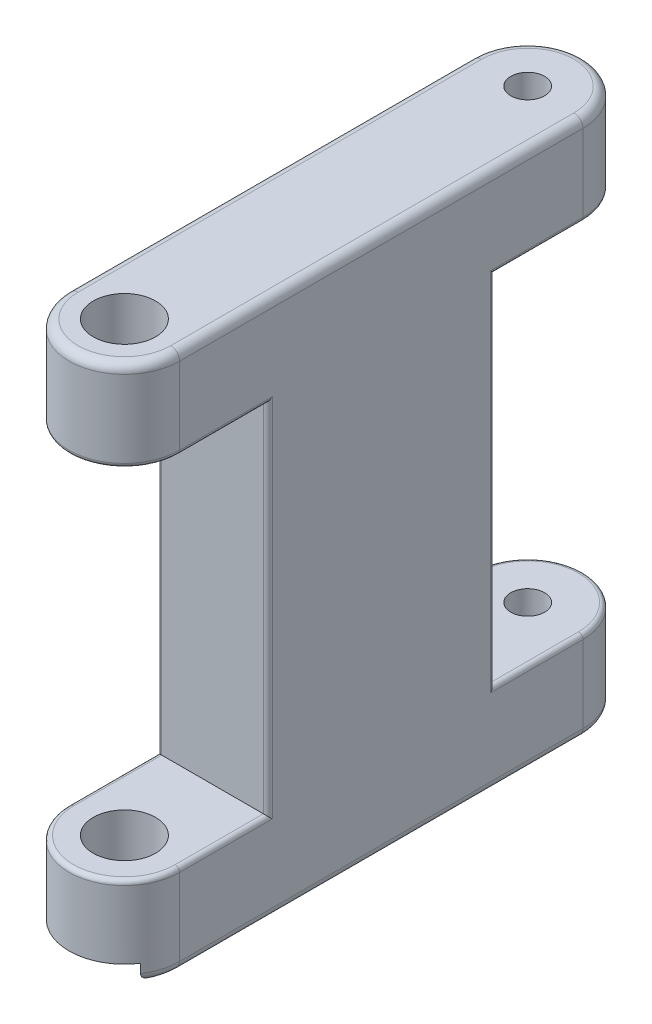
from build123d import *

# Parameters (mm, degrees)
BOSS_EXTRUDE1_DEPTH = 60
FILLET1_R           = 1
SERVOMOUNT_DEPTH    = 2
SKETCH4_R           = 1.8875
SKETCH4_R_2         = 3.475
HOLES_DEPTH         = 80.096800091
SKETCH2_W           = 22.957059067
SKETCH2_H           = 39.8
SPACE_DEPTH         = 50
FILLET2_R           = 0.5


with BuildPart() as part:
    # Sketch1 → Boss-Extrude1 (new body)
    with BuildSketch(Plane(origin=(0, 0, 0), x_dir=(1, 0, 0), z_dir=(0, 1, 0))):
        with BuildLine():
            Line((6.168831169, 0), (6.168831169, -45))
            ThreePointArc((6.168831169, -45), (0, -51.168831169), (-6.168831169, -45))
            Line((-6.168831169, -45), (-6.168831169, 0))
            ThreePointArc((-6.168831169, 0), (0, 6.168831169), (6.168831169, 0))
        make_face()
    extrude(amount=BOSS_EXTRUDE1_DEPTH)

    # Fillet1
    fillet1_edges = [part.edges().sort_by_distance(p)[0] for p in [
        (0, 60, 51.168831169),
        (6.168831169, 60, 22.5),
        (0, 60, -6.168831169),
        (6.168831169, 0, 22.5),
        (0, 0, 51.168831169),
        (-6.168831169, 0, 22.5),
        (0, 0, -6.168831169),
        (-6.168831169, 60, 22.5),
    ]]
    fillet(fillet1_edges, radius=FILLET1_R)

    # Sketch3 → servomount (cut)
    with BuildSketch(Plane.XZ):
        Polygon((-5.168831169, 40.930469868), (-2.75, 20), (2.75, 20), (5.168831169, 40.930469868), (5.168831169, 52.628952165), (-5.168831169, 52.628952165), align=None)
    extrude(amount=-SERVOMOUNT_DEPTH, mode=Mode.SUBTRACT)

    # Sketch4 → holes (cut, through all)
    with BuildSketch(Plane(origin=(0, 60, 0), x_dir=(1, 0, 0), z_dir=(0, 1, 0))):
        with Locations(Location((0, 0, 0), (0, 0, 270))):
            Circle(SKETCH4_R)
        with Locations(Location((0, -45, 0), (0, 0, 270))):
            Circle(SKETCH4_R_2)
    extrude(amount=-HOLES_DEPTH, mode=Mode.SUBTRACT)

    # Sketch2 → space (cut)
    with BuildSketch(Plane.ZY.offset(6.168831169)):
        with Locations((-1.647360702, 30)):
            Rectangle(SKETCH2_W, SKETCH2_H)
        with Locations((46.647360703, 30)):
            Rectangle(SKETCH2_W, SKETCH2_H)
    extrude(amount=-SPACE_DEPTH, mode=Mode.SUBTRACT)

    # Fillet2
    fillet2_edges = [part.edges().sort_by_distance(p)[0] for p in [
        (0, 49.9, 51.168831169),
        (6.168831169, 49.9, 40.084415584),
        (6.168831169, 10.1, 40.084415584),
        (0, 10.1, 51.168831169),
        (-6.168831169, 49.9, 40.084415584),
        (-6.168831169, 30, 35.168831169),
        (-6.168831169, 10.1, 40.084415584),
        (6.168831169, 30, 9.831168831),
        (-6.168831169, 49.9, 4.915584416),
        (-6.168831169, 10.1, 4.915584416),
        (-6.168831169, 30, 9.831168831),
        (6.168831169, 49.9, 4.915584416),
        (0, 49.9, -6.168831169),
        (0, 10.1, -6.168831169),
        (6.168831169, 10.1, 4.915584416),
        (6.168831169, 30, 35.168831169),
    ]]
    fillet(fillet2_edges, radius=FILLET2_R)


solid = part.part
